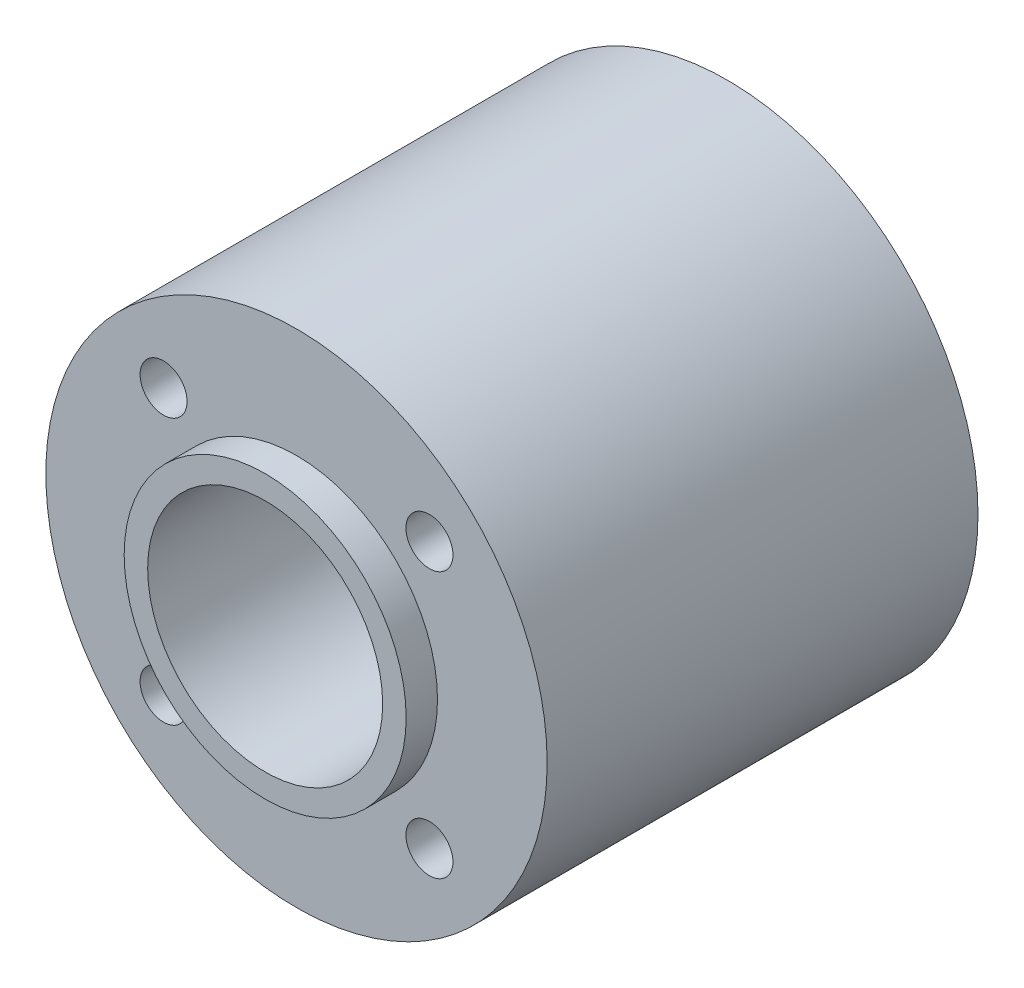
from build123d import *

# Parameters (mm, degrees)
ESQUISSE1_R             = 16
BOSS_EXTRU_1_DEPTH      = 13.75
ESQUISSE2_R             = 1.5
ENL_V_MAT_EXTRU_1_DEPTH = 36.612497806
ESQUISSE3_R             = 7.5
ENL_V_MAT_EXTRU_2_DEPTH = 36.612497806
BOSS_EXTRU_2_START      = 2
ESQUISSE4_R             = 9
ESQUISSE4_R_2           = 7.5
BOSS_EXTRU_2_DEPTH      = 2


with BuildPart() as part:
    # Esquisse1 → Boss.-Extru.1 (new, symmetric)
    with BuildSketch(Plane.XY):
        Circle(ESQUISSE1_R)
    extrude(amount=BOSS_EXTRU_1_DEPTH, both=True)

    # Esquisse2 → Enl_v. mat.-Extru.1 (cut, through all)
    with BuildSketch(Plane.XY.offset(13.75)):
        with Locations((-8.485281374, 8.485281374)):
            Circle(ESQUISSE2_R)
        with Locations((8.485281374, 8.485281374)):
            Circle(ESQUISSE2_R)
        with Locations((8.485281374, -8.485281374)):
            Circle(ESQUISSE2_R)
        with Locations((-8.485281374, -8.485281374)):
            Circle(ESQUISSE2_R)
    extrude(amount=-ENL_V_MAT_EXTRU_1_DEPTH, mode=Mode.SUBTRACT)

    # Esquisse3 → Enl_v. mat.-Extru.2 (cut, through all)
    with BuildSketch(Plane.XY.offset(13.75)):
        Circle(ESQUISSE3_R)
    extrude(amount=-ENL_V_MAT_EXTRU_2_DEPTH, mode=Mode.SUBTRACT)

    # Esquisse4 → Boss.-Extru.2 (add)
    with BuildSketch(Plane.XY.offset(13.75).offset(BOSS_EXTRU_2_START)):
        Circle(ESQUISSE4_R)
        Circle(ESQUISSE4_R_2, mode=Mode.SUBTRACT)
    boss_extru_2 = extrude(amount=-BOSS_EXTRU_2_DEPTH)

    # Sym_trie1: Boss.-Extru.2 across plane
    add(boss_extru_2.mirror(Plane.XY))


solid = part.part
